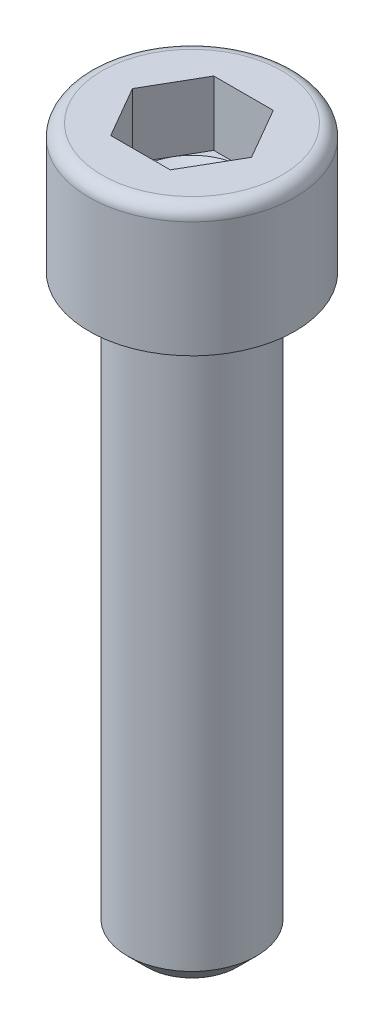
ISO-10303-21;
HEADER;
FILE_DESCRIPTION(('STEP AP214'),'2;1');
FILE_NAME('part.step','',(''),(''),'','','');
FILE_SCHEMA(('AUTOMOTIVE_DESIGN { 1 0 10303 214 1 1 1 1 }'));
ENDSEC;
DATA;
#1=APPLICATION_CONTEXT('core data for automotive mechanical design processes');
#2=APPLICATION_PROTOCOL_DEFINITION('international standard','automotive_design',2000,#1);
#3=PRODUCT_CONTEXT('',#1,'mechanical');
#4=PRODUCT('Part','Part','',(#3));
#5=PRODUCT_RELATED_PRODUCT_CATEGORY('part','',(#4));
#6=PRODUCT_DEFINITION_FORMATION('','',#4);
#7=PRODUCT_DEFINITION_CONTEXT('part definition',#1,'design');
#8=PRODUCT_DEFINITION('design','',#6,#7);
#9=PRODUCT_DEFINITION_SHAPE('','',#8);
#10=(LENGTH_UNIT() NAMED_UNIT(*) SI_UNIT(.MILLI.,.METRE.));
#11=(NAMED_UNIT(*) PLANE_ANGLE_UNIT() SI_UNIT($,.RADIAN.));
#12=(NAMED_UNIT(*) SI_UNIT($,.STERADIAN.) SOLID_ANGLE_UNIT());
#13=UNCERTAINTY_MEASURE_WITH_UNIT(LENGTH_MEASURE(1.E-05),#10,'distance_accuracy_value','');
#14=(GEOMETRIC_REPRESENTATION_CONTEXT(3) GLOBAL_UNCERTAINTY_ASSIGNED_CONTEXT((#13)) GLOBAL_UNIT_ASSIGNED_CONTEXT((#10,
#11,#12)) REPRESENTATION_CONTEXT('',''));
#15=CARTESIAN_POINT('',(0.,0.,0.));
#16=DIRECTION('',(0.,0.,1.));
#17=DIRECTION('',(1.,0.,0.));
#18=AXIS2_PLACEMENT_3D('',#15,#16,#17);
#19=CARTESIAN_POINT('',(4.,10.,0.));
#20=DIRECTION('',(0.,-1.,0.));
#21=DIRECTION('',(1.,0.,0.));
#22=AXIS2_PLACEMENT_3D('',#19,#20,#21);
#23=PLANE('',#22);
#24=CARTESIAN_POINT('',(0.,10.,0.));
#25=DIRECTION('',(0.,1.,0.));
#26=DIRECTION('',(-1.,0.,0.));
#27=AXIS2_PLACEMENT_3D('',#24,#25,#26);
#28=CIRCLE('',#27,7.);
#29=CARTESIAN_POINT('',(-7.,10.,0.));
#30=VERTEX_POINT('',#29);
#31=EDGE_CURVE('E140',#30,#30,#28,.T.);
#32=ORIENTED_EDGE('',*,*,#31,.T.);
#33=EDGE_LOOP('',(#32));
#34=FACE_BOUND('',#33,.T.);
#35=DIRECTION('',(0.499999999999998,0.,0.86602540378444));
#36=VECTOR('',#35,1.);
#37=CARTESIAN_POINT('',(2.30940107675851,10.,-4.));
#38=LINE('',#37,#36);
#39=CARTESIAN_POINT('',(2.30940107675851,10.,-4.));
#40=VERTEX_POINT('',#39);
#41=CARTESIAN_POINT('',(4.618802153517,10.,0.));
#42=VERTEX_POINT('',#41);
#43=EDGE_CURVE('E372',#40,#42,#38,.T.);
#44=ORIENTED_EDGE('',*,*,#43,.T.);
#45=DIRECTION('',(-0.499999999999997,0.,0.86602540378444));
#46=VECTOR('',#45,1.);
#47=CARTESIAN_POINT('',(2.30940107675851,10.,4.));
#48=LINE('',#47,#46);
#49=CARTESIAN_POINT('',(2.30940107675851,10.,4.));
#50=VERTEX_POINT('',#49);
#51=EDGE_CURVE('E375',#42,#50,#48,.T.);
#52=ORIENTED_EDGE('',*,*,#51,.T.);
#53=DIRECTION('',(-1.,0.,0.));
#54=VECTOR('',#53,1.);
#55=CARTESIAN_POINT('',(2.30940107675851,10.,4.));
#56=LINE('',#55,#54);
#57=CARTESIAN_POINT('',(-2.30940107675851,10.,4.));
#58=VERTEX_POINT('',#57);
#59=EDGE_CURVE('E378',#50,#58,#56,.T.);
#60=ORIENTED_EDGE('',*,*,#59,.T.);
#61=DIRECTION('',(-0.499999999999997,0.,-0.86602540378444));
#62=VECTOR('',#61,1.);
#63=CARTESIAN_POINT('',(-2.30940107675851,10.,4.));
#64=LINE('',#63,#62);
#65=CARTESIAN_POINT('',(-4.618802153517,10.,0.));
#66=VERTEX_POINT('',#65);
#67=EDGE_CURVE('E117',#58,#66,#64,.T.);
#68=ORIENTED_EDGE('',*,*,#67,.T.);
#69=DIRECTION('',(0.499999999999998,0.,-0.86602540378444));
#70=VECTOR('',#69,1.);
#71=CARTESIAN_POINT('',(-2.30940107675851,10.,-4.));
#72=LINE('',#71,#70);
#73=CARTESIAN_POINT('',(-2.30940107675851,10.,-4.));
#74=VERTEX_POINT('',#73);
#75=EDGE_CURVE('E369',#66,#74,#72,.T.);
#76=ORIENTED_EDGE('',*,*,#75,.T.);
#77=DIRECTION('',(1.,0.,0.));
#78=VECTOR('',#77,1.);
#79=CARTESIAN_POINT('',(2.30940107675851,10.,-4.));
#80=LINE('',#79,#78);
#81=EDGE_CURVE('E128',#74,#40,#80,.T.);
#82=ORIENTED_EDGE('',*,*,#81,.T.);
#83=EDGE_LOOP('',(#44,#52,#60,#68,#76,#82));
#84=FACE_BOUND('',#83,.T.);
#85=ADVANCED_FACE('F34',(#34,#84),#23,.F.);
#86=CARTESIAN_POINT('',(0.,-45.,0.));
#87=DIRECTION('',(0.,1.,0.));
#88=DIRECTION('',(0.,0.,1.));
#89=AXIS2_PLACEMENT_3D('',#86,#87,#88);
#90=CYLINDRICAL_SURFACE('',#89,5.);
#91=CARTESIAN_POINT('',(0.,-43.5,0.));
#92=DIRECTION('',(0.,1.,0.));
#93=DIRECTION('',(0.,0.,1.));
#94=AXIS2_PLACEMENT_3D('',#91,#92,#93);
#95=CIRCLE('',#94,5.);
#96=CARTESIAN_POINT('',(0.,-43.5,5.));
#97=VERTEX_POINT('',#96);
#98=EDGE_CURVE('E42',#97,#97,#95,.T.);
#99=CARTESIAN_POINT('',(0.,0.,0.));
#100=DIRECTION('',(0.,1.,0.));
#101=DIRECTION('',(0.,0.,1.));
#102=AXIS2_PLACEMENT_3D('',#99,#100,#101);
#103=CIRCLE('',#102,5.);
#104=CARTESIAN_POINT('',(0.,0.,5.));
#105=VERTEX_POINT('',#104);
#106=EDGE_CURVE('E150',#105,#105,#103,.T.);
#107=CARTESIAN_POINT('',(0.,-43.5,5.));
#108=CARTESIAN_POINT('',(0.,-43.046875,5.));
#109=CARTESIAN_POINT('',(0.,-42.59375,5.));
#110=CARTESIAN_POINT('',(0.,-41.6875,5.));
#111=CARTESIAN_POINT('',(0.,-41.234375,5.));
#112=CARTESIAN_POINT('',(0.,-40.328125,5.));
#113=CARTESIAN_POINT('',(0.,-39.875,5.));
#114=CARTESIAN_POINT('',(0.,-38.96875,5.));
#115=CARTESIAN_POINT('',(0.,-38.515625,5.));
#116=CARTESIAN_POINT('',(0.,-37.609375,5.));
#117=CARTESIAN_POINT('',(0.,-37.15625,5.));
#118=CARTESIAN_POINT('',(0.,-36.25,5.));
#119=CARTESIAN_POINT('',(0.,-35.796875,5.));
#120=CARTESIAN_POINT('',(0.,-34.890625,5.));
#121=CARTESIAN_POINT('',(0.,-34.4375,5.));
#122=CARTESIAN_POINT('',(0.,-33.53125,5.));
#123=CARTESIAN_POINT('',(0.,-33.078125,5.));
#124=CARTESIAN_POINT('',(0.,-32.171875,5.));
#125=CARTESIAN_POINT('',(0.,-31.71875,5.));
#126=CARTESIAN_POINT('',(0.,-30.8125,5.));
#127=CARTESIAN_POINT('',(0.,-30.359375,5.));
#128=CARTESIAN_POINT('',(0.,-29.453125,5.));
#129=CARTESIAN_POINT('',(0.,-29.,5.));
#130=CARTESIAN_POINT('',(0.,-28.09375,5.));
#131=CARTESIAN_POINT('',(0.,-27.640625,5.));
#132=CARTESIAN_POINT('',(0.,-26.734375,5.));
#133=CARTESIAN_POINT('',(0.,-26.28125,5.));
#134=CARTESIAN_POINT('',(0.,-25.375,5.));
#135=CARTESIAN_POINT('',(0.,-24.921875,5.));
#136=CARTESIAN_POINT('',(0.,-24.015625,5.));
#137=CARTESIAN_POINT('',(0.,-23.5625,5.));
#138=CARTESIAN_POINT('',(0.,-22.65625,5.));
#139=CARTESIAN_POINT('',(0.,-22.203125,5.));
#140=CARTESIAN_POINT('',(0.,-21.296875,5.));
#141=CARTESIAN_POINT('',(0.,-20.84375,5.));
#142=CARTESIAN_POINT('',(0.,-19.9375,5.));
#143=CARTESIAN_POINT('',(0.,-19.484375,5.));
#144=CARTESIAN_POINT('',(0.,-18.578125,5.));
#145=CARTESIAN_POINT('',(0.,-18.125,5.));
#146=CARTESIAN_POINT('',(0.,-17.21875,5.));
#147=CARTESIAN_POINT('',(0.,-16.765625,5.));
#148=CARTESIAN_POINT('',(0.,-15.859375,5.));
#149=CARTESIAN_POINT('',(0.,-15.40625,5.));
#150=CARTESIAN_POINT('',(0.,-14.5,5.));
#151=CARTESIAN_POINT('',(0.,-14.046875,5.));
#152=CARTESIAN_POINT('',(0.,-13.140625,5.));
#153=CARTESIAN_POINT('',(0.,-12.6875,5.));
#154=CARTESIAN_POINT('',(0.,-11.78125,5.));
#155=CARTESIAN_POINT('',(0.,-11.328125,5.));
#156=CARTESIAN_POINT('',(0.,-10.421875,5.));
#157=CARTESIAN_POINT('',(0.,-9.96875000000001,5.));
#158=CARTESIAN_POINT('',(0.,-9.06250000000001,5.));
#159=CARTESIAN_POINT('',(0.,-8.60937500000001,5.));
#160=CARTESIAN_POINT('',(0.,-7.70312500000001,5.));
#161=CARTESIAN_POINT('',(0.,-7.25000000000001,5.));
#162=CARTESIAN_POINT('',(0.,-6.34375000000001,5.));
#163=CARTESIAN_POINT('',(0.,-5.89062500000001,5.));
#164=CARTESIAN_POINT('',(0.,-4.98437500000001,5.));
#165=CARTESIAN_POINT('',(0.,-4.53125000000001,5.));
#166=CARTESIAN_POINT('',(0.,-3.62500000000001,5.));
#167=CARTESIAN_POINT('',(0.,-3.17187500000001,5.));
#168=CARTESIAN_POINT('',(0.,-2.26562500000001,5.));
#169=CARTESIAN_POINT('',(0.,-1.81250000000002,5.));
#170=CARTESIAN_POINT('',(0.,-0.906250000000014,5.));
#171=CARTESIAN_POINT('',(0.,-0.45312500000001,5.));
#172=CARTESIAN_POINT('',(0.,0.,5.));
#173=B_SPLINE_CURVE_WITH_KNOTS('',3,(#107,#108,#109,#110,#111,#112,#113,#114,#115,#116,#117,
#118,#119,#120,#121,#122,#123,#124,#125,#126,#127,#128,#129,#130,#131,#132,#133,#134,#135,#136,
#137,#138,#139,#140,#141,#142,#143,#144,#145,#146,#147,#148,#149,#150,#151,#152,#153,#154,#155,
#156,#157,#158,#159,#160,#161,#162,#163,#164,#165,#166,#167,#168,#169,#170,#171,#172),
.UNSPECIFIED.,.F.,.F.,(4,2,2,2,2,2,2,2,2,2,2,2,2,2,2,2,2,2,2,2,2,2,2,2,2,2,2,2,2,2,2,2,4),(0.,
1.359375,2.71875,4.078125,5.4375,6.796875,8.15625,9.515625,10.875,12.234375,13.59375,14.953125,
16.3125,17.671875,19.03125,20.390625,21.75,23.109375,24.46875,25.828125,27.1875,28.546875,
29.90625,31.265625,32.625,33.984375,35.34375,36.703125,38.0625,39.421875,40.78125,42.140625,
43.5),.UNSPECIFIED.);
#174=EDGE_CURVE('BSEAM155',#97,#105,#173,.T.);
#175=ORIENTED_EDGE('',*,*,#98,.T.);
#176=ORIENTED_EDGE('',*,*,#106,.F.);
#177=ORIENTED_EDGE('',*,*,#174,.T.);
#178=ORIENTED_EDGE('',*,*,#174,.F.);
#179=EDGE_LOOP('',(#175,#177,#176,#178));
#180=FACE_BOUND('',#179,.T.);
#181=ADVANCED_FACE('F155',(#180),#90,.T.);
#182=CARTESIAN_POINT('',(0.,-45.,0.));
#183=DIRECTION('',(0.,1.,0.));
#184=DIRECTION('',(0.,0.,1.));
#185=AXIS2_PLACEMENT_3D('',#182,#183,#184);
#186=PLANE('',#185);
#187=CARTESIAN_POINT('',(0.,-45.,0.));
#188=DIRECTION('',(0.,1.,0.));
#189=DIRECTION('',(0.,0.,1.));
#190=AXIS2_PLACEMENT_3D('',#187,#188,#189);
#191=CIRCLE('',#190,3.49999999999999);
#192=CARTESIAN_POINT('',(0.,-45.,3.49999999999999));
#193=VERTEX_POINT('',#192);
#194=EDGE_CURVE('E11',#193,#193,#191,.F.);
#195=ORIENTED_EDGE('',*,*,#194,.T.);
#196=EDGE_LOOP('',(#195));
#197=FACE_BOUND('',#196,.T.);
#198=ADVANCED_FACE('F160',(#197),#186,.F.);
#199=CARTESIAN_POINT('',(0.,-43.5,0.));
#200=DIRECTION('',(0.,1.,0.));
#201=DIRECTION('',(0.,0.,1.));
#202=AXIS2_PLACEMENT_3D('',#199,#200,#201);
#203=CONICAL_SURFACE('',#202,5.,0.78539816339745);
#204=ORIENTED_EDGE('',*,*,#194,.F.);
#205=EDGE_LOOP('',(#204));
#206=FACE_BOUND('',#205,.T.);
#207=ORIENTED_EDGE('',*,*,#98,.F.);
#208=EDGE_LOOP('',(#207));
#209=FACE_BOUND('',#208,.T.);
#210=ADVANCED_FACE('F36',(#206,#209),#203,.T.);
#211=CARTESIAN_POINT('',(0.,0.,0.));
#212=DIRECTION('',(0.,1.,0.));
#213=DIRECTION('',(-1.,0.,0.));
#214=AXIS2_PLACEMENT_3D('',#211,#212,#213);
#215=PLANE('',#214);
#216=ORIENTED_EDGE('',*,*,#106,.T.);
#217=EDGE_LOOP('',(#216));
#218=FACE_BOUND('',#217,.T.);
#219=CARTESIAN_POINT('',(0.,0.,0.));
#220=DIRECTION('',(0.,1.,0.));
#221=DIRECTION('',(-1.,0.,0.));
#222=AXIS2_PLACEMENT_3D('',#219,#220,#221);
#223=CIRCLE('',#222,8.);
#224=CARTESIAN_POINT('',(-8.,0.,0.));
#225=VERTEX_POINT('',#224);
#226=EDGE_CURVE('E147',#225,#225,#223,.T.);
#227=ORIENTED_EDGE('',*,*,#226,.F.);
#228=EDGE_LOOP('',(#227));
#229=FACE_BOUND('',#228,.T.);
#230=ADVANCED_FACE('F159',(#218,#229),#215,.F.);
#231=CARTESIAN_POINT('',(0.,10.,0.));
#232=DIRECTION('',(0.,1.,0.));
#233=DIRECTION('',(-1.,0.,0.));
#234=AXIS2_PLACEMENT_3D('',#231,#232,#233);
#235=CYLINDRICAL_SURFACE('',#234,8.);
#236=CARTESIAN_POINT('',(0.,9.,0.));
#237=DIRECTION('',(0.,1.,0.));
#238=DIRECTION('',(-1.,0.,0.));
#239=AXIS2_PLACEMENT_3D('',#236,#237,#238);
#240=CIRCLE('',#239,8.);
#241=CARTESIAN_POINT('',(-8.,9.,0.));
#242=VERTEX_POINT('',#241);
#243=EDGE_CURVE('E144',#242,#242,#240,.T.);
#244=ORIENTED_EDGE('',*,*,#243,.F.);
#245=EDGE_LOOP('',(#244));
#246=FACE_BOUND('',#245,.T.);
#247=ORIENTED_EDGE('',*,*,#226,.T.);
#248=EDGE_LOOP('',(#247));
#249=FACE_BOUND('',#248,.T.);
#250=ADVANCED_FACE('F166',(#246,#249),#235,.T.);
#251=CARTESIAN_POINT('',(0.,9.,0.));
#252=DIRECTION('',(0.,1.,0.));
#253=DIRECTION('',(-1.,0.,0.));
#254=AXIS2_PLACEMENT_3D('',#251,#252,#253);
#255=TOROIDAL_SURFACE('',#254,7.,0.999999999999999);
#256=ORIENTED_EDGE('',*,*,#31,.F.);
#257=EDGE_LOOP('',(#256));
#258=FACE_BOUND('',#257,.T.);
#259=ORIENTED_EDGE('',*,*,#243,.T.);
#260=EDGE_LOOP('',(#259));
#261=FACE_BOUND('',#260,.T.);
#262=ADVANCED_FACE('F183',(#258,#261),#255,.T.);
#263=CARTESIAN_POINT('',(-2.30940107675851,5.,-4.));
#264=DIRECTION('',(0.86602540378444,0.,0.499999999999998));
#265=DIRECTION('',(0.499999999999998,0.,-0.86602540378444));
#266=AXIS2_PLACEMENT_3D('',#263,#264,#265);
#267=PLANE('',#266);
#268=ORIENTED_EDGE('',*,*,#75,.F.);
#269=DIRECTION('',(0.,1.,0.));
#270=VECTOR('',#269,1.);
#271=CARTESIAN_POINT('',(-4.618802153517,5.,0.));
#272=LINE('',#271,#270);
#273=CARTESIAN_POINT('',(-4.618802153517,5.,0.));
#274=VERTEX_POINT('',#273);
#275=EDGE_CURVE('E364',#274,#66,#272,.T.);
#276=ORIENTED_EDGE('',*,*,#275,.F.);
#277=DIRECTION('',(0.499999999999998,0.,-0.86602540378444));
#278=VECTOR('',#277,1.);
#279=CARTESIAN_POINT('',(-2.30940107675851,5.,-4.));
#280=LINE('',#279,#278);
#281=CARTESIAN_POINT('',(-3.46410161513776,5.,-1.99999999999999));
#282=VERTEX_POINT('',#281);
#283=EDGE_CURVE('E113',#274,#282,#280,.T.);
#284=ORIENTED_EDGE('',*,*,#283,.T.);
#285=CARTESIAN_POINT('',(-2.30940107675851,5.,-4.));
#286=VERTEX_POINT('',#285);
#287=EDGE_CURVE('E107',#282,#286,#280,.T.);
#288=ORIENTED_EDGE('',*,*,#287,.T.);
#289=DIRECTION('',(0.,1.,0.));
#290=VECTOR('',#289,1.);
#291=CARTESIAN_POINT('',(-2.30940107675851,5.,-4.));
#292=LINE('',#291,#290);
#293=EDGE_CURVE('E109',#286,#74,#292,.T.);
#294=ORIENTED_EDGE('',*,*,#293,.T.);
#295=EDGE_LOOP('',(#268,#276,#284,#288,#294));
#296=FACE_BOUND('',#295,.T.);
#297=ADVANCED_FACE('F108',(#296),#267,.T.);
#298=CARTESIAN_POINT('',(2.30940107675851,5.,-4.));
#299=DIRECTION('',(0.,0.,1.));
#300=DIRECTION('',(1.,0.,0.));
#301=AXIS2_PLACEMENT_3D('',#298,#299,#300);
#302=PLANE('',#301);
#303=ORIENTED_EDGE('',*,*,#81,.F.);
#304=ORIENTED_EDGE('',*,*,#293,.F.);
#305=DIRECTION('',(1.,0.,0.));
#306=VECTOR('',#305,1.);
#307=CARTESIAN_POINT('',(2.30940107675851,5.,-4.));
#308=LINE('',#307,#306);
#309=CARTESIAN_POINT('',(0.,5.,-4.));
#310=VERTEX_POINT('',#309);
#311=EDGE_CURVE('E49',#286,#310,#308,.T.);
#312=ORIENTED_EDGE('',*,*,#311,.T.);
#313=CARTESIAN_POINT('',(2.30940107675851,5.,-4.));
#314=VERTEX_POINT('',#313);
#315=EDGE_CURVE('E123',#310,#314,#308,.T.);
#316=ORIENTED_EDGE('',*,*,#315,.T.);
#317=DIRECTION('',(0.,1.,0.));
#318=VECTOR('',#317,1.);
#319=CARTESIAN_POINT('',(2.30940107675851,5.,-4.));
#320=LINE('',#319,#318);
#321=EDGE_CURVE('E130',#314,#40,#320,.T.);
#322=ORIENTED_EDGE('',*,*,#321,.T.);
#323=EDGE_LOOP('',(#303,#304,#312,#316,#322));
#324=FACE_BOUND('',#323,.T.);
#325=ADVANCED_FACE('F125',(#324),#302,.T.);
#326=CARTESIAN_POINT('',(2.30940107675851,5.,-4.));
#327=DIRECTION('',(-0.86602540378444,0.,0.499999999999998));
#328=DIRECTION('',(0.499999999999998,0.,0.86602540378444));
#329=AXIS2_PLACEMENT_3D('',#326,#327,#328);
#330=PLANE('',#329);
#331=ORIENTED_EDGE('',*,*,#43,.F.);
#332=ORIENTED_EDGE('',*,*,#321,.F.);
#333=DIRECTION('',(0.499999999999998,0.,0.86602540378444));
#334=VECTOR('',#333,1.);
#335=CARTESIAN_POINT('',(2.30940107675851,5.,-4.));
#336=LINE('',#335,#334);
#337=CARTESIAN_POINT('',(3.46410161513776,5.,-1.99999999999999));
#338=VERTEX_POINT('',#337);
#339=EDGE_CURVE('E397',#314,#338,#336,.T.);
#340=ORIENTED_EDGE('',*,*,#339,.T.);
#341=CARTESIAN_POINT('',(4.618802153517,5.,0.));
#342=VERTEX_POINT('',#341);
#343=EDGE_CURVE('E122',#338,#342,#336,.T.);
#344=ORIENTED_EDGE('',*,*,#343,.T.);
#345=DIRECTION('',(0.,1.,0.));
#346=VECTOR('',#345,1.);
#347=CARTESIAN_POINT('',(4.618802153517,5.,0.));
#348=LINE('',#347,#346);
#349=EDGE_CURVE('E135',#342,#42,#348,.T.);
#350=ORIENTED_EDGE('',*,*,#349,.T.);
#351=EDGE_LOOP('',(#331,#332,#340,#344,#350));
#352=FACE_BOUND('',#351,.T.);
#353=ADVANCED_FACE('F213',(#352),#330,.T.);
#354=CARTESIAN_POINT('',(2.30940107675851,5.,4.));
#355=DIRECTION('',(-0.86602540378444,0.,-0.499999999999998));
#356=DIRECTION('',(-0.499999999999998,0.,0.86602540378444));
#357=AXIS2_PLACEMENT_3D('',#354,#355,#356);
#358=PLANE('',#357);
#359=ORIENTED_EDGE('',*,*,#51,.F.);
#360=ORIENTED_EDGE('',*,*,#349,.F.);
#361=DIRECTION('',(-0.499999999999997,0.,0.86602540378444));
#362=VECTOR('',#361,1.);
#363=CARTESIAN_POINT('',(2.30940107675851,5.,4.));
#364=LINE('',#363,#362);
#365=CARTESIAN_POINT('',(3.46410161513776,5.,1.99999999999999));
#366=VERTEX_POINT('',#365);
#367=EDGE_CURVE('E395',#342,#366,#364,.T.);
#368=ORIENTED_EDGE('',*,*,#367,.T.);
#369=CARTESIAN_POINT('',(2.30940107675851,5.,4.));
#370=VERTEX_POINT('',#369);
#371=EDGE_CURVE('E396',#366,#370,#364,.T.);
#372=ORIENTED_EDGE('',*,*,#371,.T.);
#373=DIRECTION('',(0.,1.,0.));
#374=VECTOR('',#373,1.);
#375=CARTESIAN_POINT('',(2.30940107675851,5.,4.));
#376=LINE('',#375,#374);
#377=EDGE_CURVE('E384',#370,#50,#376,.T.);
#378=ORIENTED_EDGE('',*,*,#377,.T.);
#379=EDGE_LOOP('',(#359,#360,#368,#372,#378));
#380=FACE_BOUND('',#379,.T.);
#381=ADVANCED_FACE('F220',(#380),#358,.T.);
#382=CARTESIAN_POINT('',(2.30940107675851,5.,4.));
#383=DIRECTION('',(0.,0.,-1.));
#384=DIRECTION('',(-1.,0.,0.));
#385=AXIS2_PLACEMENT_3D('',#382,#383,#384);
#386=PLANE('',#385);
#387=ORIENTED_EDGE('',*,*,#59,.F.);
#388=ORIENTED_EDGE('',*,*,#377,.F.);
#389=DIRECTION('',(-1.,0.,0.));
#390=VECTOR('',#389,1.);
#391=CARTESIAN_POINT('',(2.30940107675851,5.,4.));
#392=LINE('',#391,#390);
#393=CARTESIAN_POINT('',(0.,5.,4.));
#394=VERTEX_POINT('',#393);
#395=EDGE_CURVE('E359',#370,#394,#392,.T.);
#396=ORIENTED_EDGE('',*,*,#395,.T.);
#397=CARTESIAN_POINT('',(-2.30940107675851,5.,4.));
#398=VERTEX_POINT('',#397);
#399=EDGE_CURVE('E355',#394,#398,#392,.T.);
#400=ORIENTED_EDGE('',*,*,#399,.T.);
#401=DIRECTION('',(0.,1.,0.));
#402=VECTOR('',#401,1.);
#403=CARTESIAN_POINT('',(-2.30940107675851,5.,4.));
#404=LINE('',#403,#402);
#405=EDGE_CURVE('E363',#398,#58,#404,.T.);
#406=ORIENTED_EDGE('',*,*,#405,.T.);
#407=EDGE_LOOP('',(#387,#388,#396,#400,#406));
#408=FACE_BOUND('',#407,.T.);
#409=ADVANCED_FACE('F228',(#408),#386,.T.);
#410=CARTESIAN_POINT('',(-2.30940107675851,5.,4.));
#411=DIRECTION('',(0.86602540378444,0.,-0.499999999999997));
#412=DIRECTION('',(-0.499999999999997,0.,-0.86602540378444));
#413=AXIS2_PLACEMENT_3D('',#410,#411,#412);
#414=PLANE('',#413);
#415=ORIENTED_EDGE('',*,*,#67,.F.);
#416=ORIENTED_EDGE('',*,*,#405,.F.);
#417=DIRECTION('',(-0.499999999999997,0.,-0.86602540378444));
#418=VECTOR('',#417,1.);
#419=CARTESIAN_POINT('',(-2.30940107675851,5.,4.));
#420=LINE('',#419,#418);
#421=CARTESIAN_POINT('',(-3.46410161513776,5.,1.99999999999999));
#422=VERTEX_POINT('',#421);
#423=EDGE_CURVE('E354',#398,#422,#420,.T.);
#424=ORIENTED_EDGE('',*,*,#423,.T.);
#425=EDGE_CURVE('E357',#422,#274,#420,.T.);
#426=ORIENTED_EDGE('',*,*,#425,.T.);
#427=ORIENTED_EDGE('',*,*,#275,.T.);
#428=EDGE_LOOP('',(#415,#416,#424,#426,#427));
#429=FACE_BOUND('',#428,.T.);
#430=ADVANCED_FACE('F236',(#429),#414,.T.);
#431=CARTESIAN_POINT('',(-6.92820323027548,5.,4.));
#432=DIRECTION('',(0.,-1.,0.));
#433=DIRECTION('',(0.,0.,-1.));
#434=AXIS2_PLACEMENT_3D('',#431,#432,#433);
#435=PLANE('',#434);
#436=ORIENTED_EDGE('',*,*,#311,.F.);
#437=ORIENTED_EDGE('',*,*,#287,.F.);
#438=CARTESIAN_POINT('',(0.,5.,0.));
#439=DIRECTION('',(0.,1.,0.));
#440=DIRECTION('',(-1.,0.,0.));
#441=AXIS2_PLACEMENT_3D('',#438,#439,#440);
#442=CIRCLE('',#441,4.);
#443=EDGE_CURVE('E120',#310,#282,#442,.T.);
#444=ORIENTED_EDGE('',*,*,#443,.F.);
#445=EDGE_LOOP('',(#436,#437,#444));
#446=FACE_BOUND('',#445,.T.);
#447=ADVANCED_FACE('F119',(#446),#435,.F.);
#448=ORIENTED_EDGE('',*,*,#283,.F.);
#449=ORIENTED_EDGE('',*,*,#425,.F.);
#450=EDGE_CURVE('E129',#282,#422,#442,.T.);
#451=ORIENTED_EDGE('',*,*,#450,.F.);
#452=EDGE_LOOP('',(#448,#449,#451));
#453=FACE_BOUND('',#452,.T.);
#454=ADVANCED_FACE('F251',(#453),#435,.F.);
#455=ORIENTED_EDGE('',*,*,#423,.F.);
#456=ORIENTED_EDGE('',*,*,#399,.F.);
#457=EDGE_CURVE('E134',#422,#394,#442,.T.);
#458=ORIENTED_EDGE('',*,*,#457,.F.);
#459=EDGE_LOOP('',(#455,#456,#458));
#460=FACE_BOUND('',#459,.T.);
#461=ADVANCED_FACE('F259',(#460),#435,.F.);
#462=ORIENTED_EDGE('',*,*,#395,.F.);
#463=ORIENTED_EDGE('',*,*,#371,.F.);
#464=EDGE_CURVE('E141',#394,#366,#442,.T.);
#465=ORIENTED_EDGE('',*,*,#464,.F.);
#466=EDGE_LOOP('',(#462,#463,#465));
#467=FACE_BOUND('',#466,.T.);
#468=ADVANCED_FACE('F266',(#467),#435,.F.);
#469=ORIENTED_EDGE('',*,*,#367,.F.);
#470=ORIENTED_EDGE('',*,*,#343,.F.);
#471=EDGE_CURVE('E401',#366,#338,#442,.T.);
#472=ORIENTED_EDGE('',*,*,#471,.F.);
#473=EDGE_LOOP('',(#469,#470,#472));
#474=FACE_BOUND('',#473,.T.);
#475=ADVANCED_FACE('F273',(#474),#435,.F.);
#476=ORIENTED_EDGE('',*,*,#339,.F.);
#477=ORIENTED_EDGE('',*,*,#315,.F.);
#478=EDGE_CURVE('E400',#338,#310,#442,.T.);
#479=ORIENTED_EDGE('',*,*,#478,.F.);
#480=EDGE_LOOP('',(#476,#477,#479));
#481=FACE_BOUND('',#480,.T.);
#482=ADVANCED_FACE('F253',(#481),#435,.F.);
#483=CARTESIAN_POINT('',(0.,5.,0.));
#484=DIRECTION('',(0.,1.,0.));
#485=DIRECTION('',(-1.,0.,0.));
#486=AXIS2_PLACEMENT_3D('',#483,#484,#485);
#487=CONICAL_SURFACE('',#486,4.,1.04719755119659);
#488=CARTESIAN_POINT('',(0.,2.69059892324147,0.));
#489=VERTEX_POINT('',#488);
#490=VERTEX_LOOP('',#489);
#491=FACE_BOUND('',#490,.T.);
#492=ORIENTED_EDGE('',*,*,#457,.T.);
#493=ORIENTED_EDGE('',*,*,#464,.T.);
#494=ORIENTED_EDGE('',*,*,#471,.T.);
#495=ORIENTED_EDGE('',*,*,#478,.T.);
#496=ORIENTED_EDGE('',*,*,#443,.T.);
#497=ORIENTED_EDGE('',*,*,#450,.T.);
#498=EDGE_LOOP('',(#492,#493,#494,#495,#496,#497));
#499=FACE_BOUND('',#498,.T.);
#500=ADVANCED_FACE('F181',(#491,#499),#487,.F.);
#501=CLOSED_SHELL('',(#85,#181,#198,#210,#230,#250,#262,#297,#325,#353,#381,#409,#430,#447,#454,
#461,#468,#475,#482,#500));
#502=MANIFOLD_SOLID_BREP('B2',#501);
#503=ADVANCED_BREP_SHAPE_REPRESENTATION('',(#18,#502),#14);
#504=SHAPE_DEFINITION_REPRESENTATION(#9,#503);
ENDSEC;
END-ISO-10303-21;
